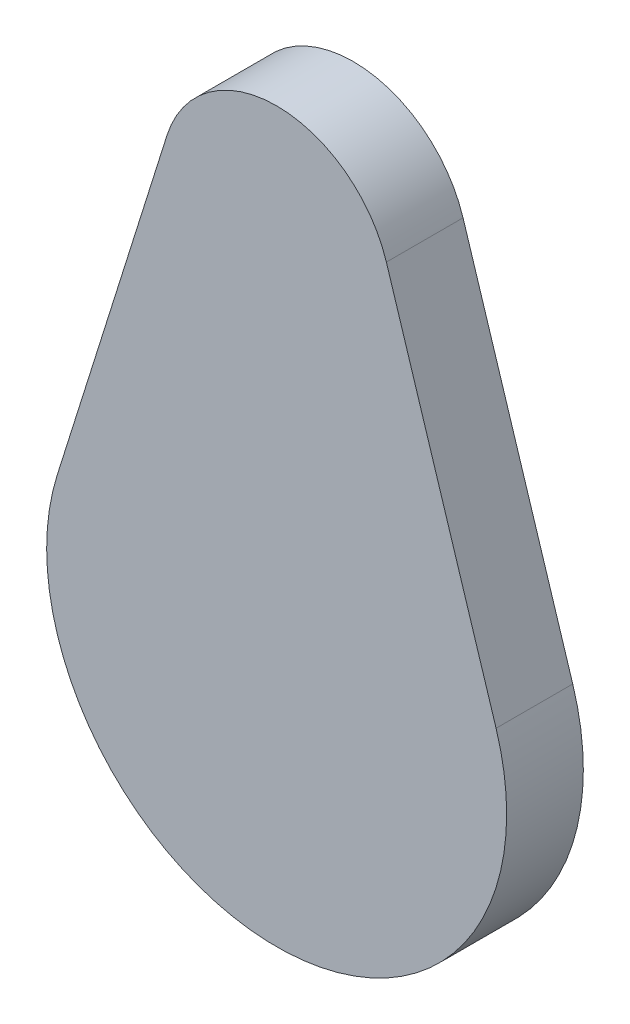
from build123d import *

# Parameters (mm, degrees)
EXTRUDE_1_DEPTH = 10


with BuildPart() as part:
    # Sketch 2 → Extrude 1 (new body)
    with BuildSketch(Plane.XY):
        with BuildLine():
            Line((-14.309088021, 54.5), (-28.618176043, 9))
            ThreePointArc((-28.618176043, 9), (0, -30), (28.618176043, 9))
            Line((28.618176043, 9), (14.309088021, 54.5))
            ThreePointArc((14.309088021, 54.5), (0, 65), (-14.309088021, 54.5))
        make_face()
    extrude(amount=EXTRUDE_1_DEPTH)


solid = part.part
